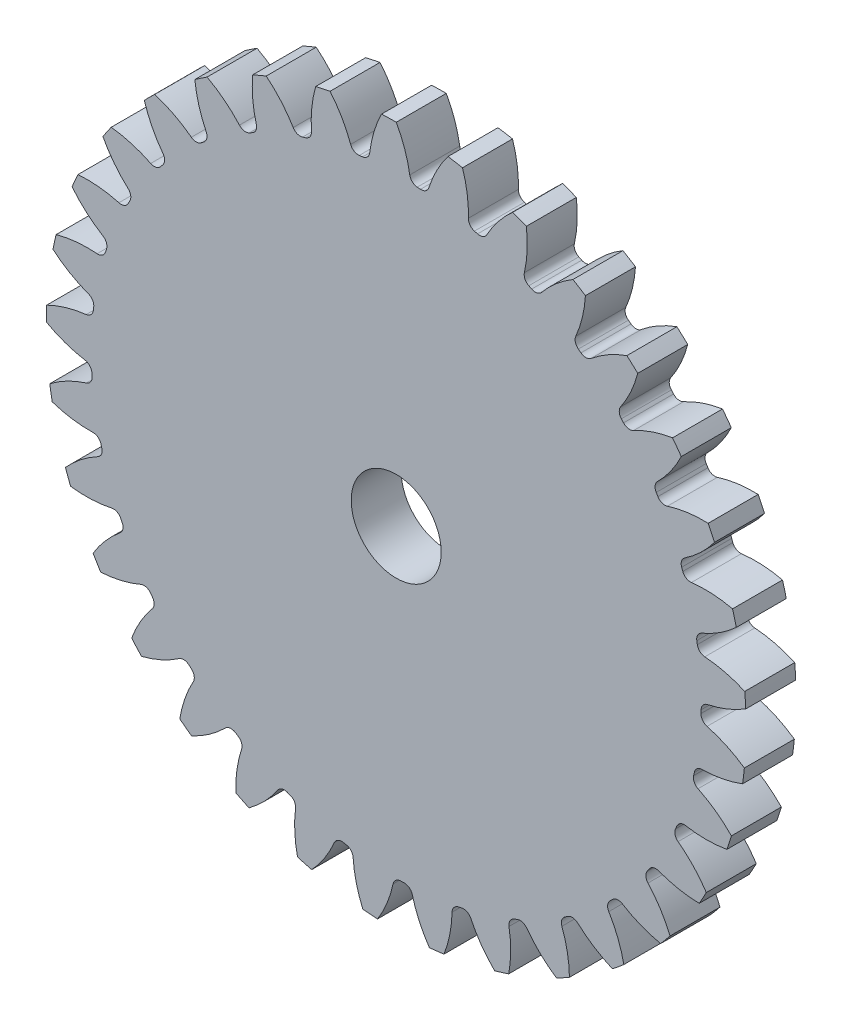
from build123d import *

# Parameters (mm, degrees)
SKETCH3_R         = 889
GEARBODY_DEPTH    = 127
TOOTHCUT_DEPTH    = 1264.634045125
CIRPATTERN1_COUNT = 33
BOREDIA_R         = 114.3
BORE_DEPTH        = 12700


with BuildPart() as part:
    # Sketch3 → gearBody (new body)
    with BuildSketch(Plane.XY):
        Circle(SKETCH3_R)
    extrude(amount=GEARBODY_DEPTH)

    # Sketch2 → toothCut (cut, through all)
    with BuildSketch(Plane.XY):
        with BuildLine():
            ThreePointArc((774.299938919, -24.893665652), (774.422077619, -20.749354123), (774.52203474, -16.604448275))
            ThreePointArc((774.52203474, -16.604448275), (779.269134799, -3.859927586), (790.905956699, 3.17869036))
            ThreePointArc((790.905956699, 3.17869036), (841.680924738, 18.664560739), (889, 42.723128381))
            ThreePointArc((889, 42.723128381), (889.706696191, -23.838214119), (885.436771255, -90.266216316))
            ThreePointArc((885.436771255, -90.266216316), (839.473880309, -63.708313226), (789.60100204, -45.525750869))
            ThreePointArc((789.60100204, -45.525750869), (778.357781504, -37.874100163), (774.299938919, -24.893665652))
        make_face()
    toothcut = extrude(amount=TOOTHCUT_DEPTH, mode=Mode.SUBTRACT)

    # CirPattern1: toothCut ×33 about axis
    cirpattern1_axis = Axis((0, 0, 0), (0, 0, 1))
    for i in range(1, CIRPATTERN1_COUNT):
        add(toothcut.rotate(cirpattern1_axis, i * 360 / CIRPATTERN1_COUNT), mode=Mode.SUBTRACT)

    # boreDia → bore (cut, symmetric)
    with BuildSketch(Plane.XY):
        Circle(BOREDIA_R)
    extrude(amount=BORE_DEPTH, both=True, mode=Mode.SUBTRACT)


solid = part.part
